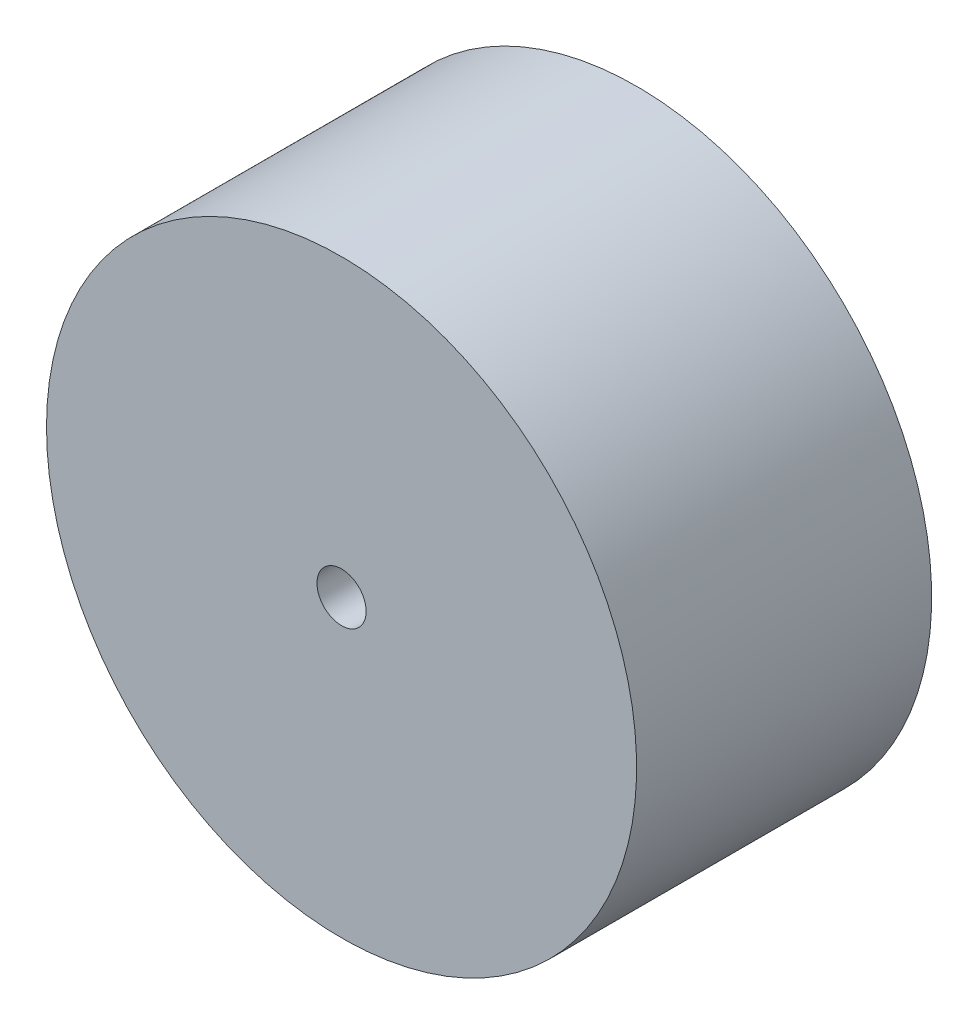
from build123d import *

# Parameters (mm, degrees)
SKETCH1_R           = 38.1
BOSS_EXTRUDE1_DEPTH = 38.1
SKETCH2_R           = 3.175
CUT_EXTRUDE1_DEPTH  = 66.991135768


with BuildPart() as part:
    # Sketch1 → Boss-Extrude1 (new body)
    with BuildSketch(Plane.XY):
        with Locations(Location((0, 0, 0), (0, 0, 180))):
            Circle(SKETCH1_R)
    extrude(amount=BOSS_EXTRUDE1_DEPTH)

    # Sketch2 → Cut-Extrude1 (cut, through all)
    with BuildSketch(Plane.XY.offset(38.1)):
        Circle(SKETCH2_R)
    extrude(amount=-CUT_EXTRUDE1_DEPTH, mode=Mode.SUBTRACT)


solid = part.part
